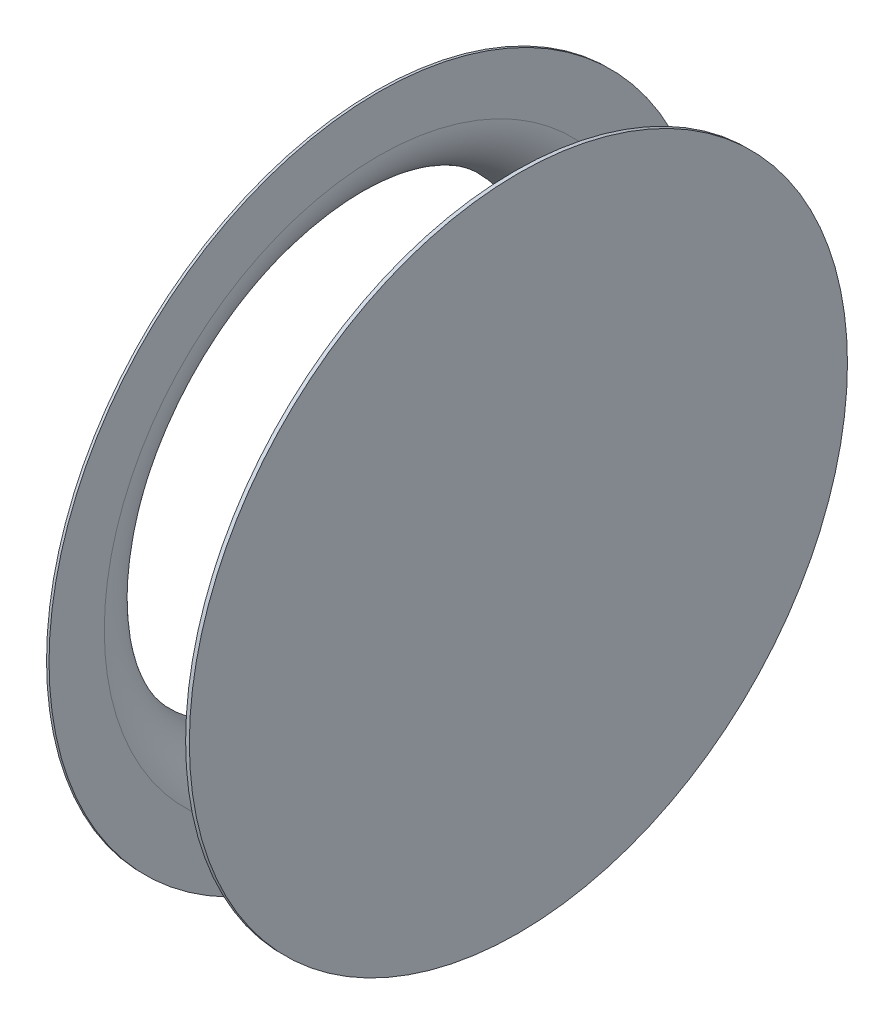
ISO-10303-21;
HEADER;
FILE_DESCRIPTION(('STEP AP214'),'2;1');
FILE_NAME('part.step','',(''),(''),'','','');
FILE_SCHEMA(('AUTOMOTIVE_DESIGN { 1 0 10303 214 1 1 1 1 }'));
ENDSEC;
DATA;
#1=APPLICATION_CONTEXT('core data for automotive mechanical design processes');
#2=APPLICATION_PROTOCOL_DEFINITION('international standard','automotive_design',2000,#1);
#3=PRODUCT_CONTEXT('',#1,'mechanical');
#4=PRODUCT('Part','Part','',(#3));
#5=PRODUCT_RELATED_PRODUCT_CATEGORY('part','',(#4));
#6=PRODUCT_DEFINITION_FORMATION('','',#4);
#7=PRODUCT_DEFINITION_CONTEXT('part definition',#1,'design');
#8=PRODUCT_DEFINITION('design','',#6,#7);
#9=PRODUCT_DEFINITION_SHAPE('','',#8);
#10=(LENGTH_UNIT() NAMED_UNIT(*) SI_UNIT(.MILLI.,.METRE.));
#11=(NAMED_UNIT(*) PLANE_ANGLE_UNIT() SI_UNIT($,.RADIAN.));
#12=(NAMED_UNIT(*) SI_UNIT($,.STERADIAN.) SOLID_ANGLE_UNIT());
#13=UNCERTAINTY_MEASURE_WITH_UNIT(LENGTH_MEASURE(1.E-05),#10,'distance_accuracy_value','');
#14=(GEOMETRIC_REPRESENTATION_CONTEXT(3) GLOBAL_UNCERTAINTY_ASSIGNED_CONTEXT((#13)) GLOBAL_UNIT_ASSIGNED_CONTEXT((#10,
#11,#12)) REPRESENTATION_CONTEXT('',''));
#15=CARTESIAN_POINT('',(0.,0.,0.));
#16=DIRECTION('',(0.,0.,1.));
#17=DIRECTION('',(1.,0.,0.));
#18=AXIS2_PLACEMENT_3D('',#15,#16,#17);
#19=CARTESIAN_POINT('',(-337.763793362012,0.,0.));
#20=DIRECTION('',(-1.,0.,0.));
#21=DIRECTION('',(0.,0.,1.));
#22=AXIS2_PLACEMENT_3D('',#19,#20,#21);
#23=CYLINDRICAL_SURFACE('',#22,530.);
#24=CARTESIAN_POINT('',(-224.,0.,0.));
#25=DIRECTION('',(-1.,0.,0.));
#26=DIRECTION('',(0.,0.,1.));
#27=AXIS2_PLACEMENT_3D('',#24,#25,#26);
#28=CIRCLE('',#27,530.);
#29=CARTESIAN_POINT('',(-224.,0.,530.));
#30=VERTEX_POINT('',#29);
#31=EDGE_CURVE('E57',#30,#30,#28,.T.);
#32=ORIENTED_EDGE('',*,*,#31,.F.);
#33=EDGE_LOOP('',(#32));
#34=FACE_BOUND('',#33,.T.);
#35=CARTESIAN_POINT('',(-220.,0.,0.));
#36=DIRECTION('',(-1.,0.,0.));
#37=DIRECTION('',(0.,0.,1.));
#38=AXIS2_PLACEMENT_3D('',#35,#36,#37);
#39=CIRCLE('',#38,530.);
#40=CARTESIAN_POINT('',(-220.,0.,530.));
#41=VERTEX_POINT('',#40);
#42=EDGE_CURVE('E11',#41,#41,#39,.T.);
#43=ORIENTED_EDGE('',*,*,#42,.T.);
#44=EDGE_LOOP('',(#43));
#45=FACE_BOUND('',#44,.T.);
#46=ADVANCED_FACE('F35',(#34,#45),#23,.T.);
#47=CARTESIAN_POINT('',(-220.,0.,-530.));
#48=DIRECTION('',(-1.,0.,0.));
#49=DIRECTION('',(0.,0.,1.));
#50=AXIS2_PLACEMENT_3D('',#47,#48,#49);
#51=PLANE('',#50);
#52=ORIENTED_EDGE('',*,*,#42,.F.);
#53=EDGE_LOOP('',(#52));
#54=FACE_BOUND('',#53,.T.);
#55=CARTESIAN_POINT('',(-220.,0.,0.));
#56=DIRECTION('',(-1.,0.,0.));
#57=DIRECTION('',(0.,0.,1.));
#58=AXIS2_PLACEMENT_3D('',#55,#56,#57);
#59=CIRCLE('',#58,441.);
#60=CARTESIAN_POINT('',(-220.,0.,441.));
#61=VERTEX_POINT('',#60);
#62=EDGE_CURVE('E41',#61,#61,#59,.T.);
#63=ORIENTED_EDGE('',*,*,#62,.T.);
#64=EDGE_LOOP('',(#63));
#65=FACE_BOUND('',#64,.T.);
#66=ADVANCED_FACE('F64',(#54,#65),#51,.F.);
#67=CARTESIAN_POINT('',(-309.,0.,0.));
#68=DIRECTION('',(-1.,0.,0.));
#69=DIRECTION('',(0.,0.,1.));
#70=AXIS2_PLACEMENT_3D('',#67,#68,#69);
#71=TOROIDAL_SURFACE('',#70,441.,89.);
#72=ORIENTED_EDGE('',*,*,#62,.F.);
#73=EDGE_LOOP('',(#72));
#74=FACE_BOUND('',#73,.T.);
#75=CARTESIAN_POINT('',(-309.,0.,0.));
#76=DIRECTION('',(-1.,0.,0.));
#77=DIRECTION('',(0.,0.,1.));
#78=AXIS2_PLACEMENT_3D('',#75,#76,#77);
#79=CIRCLE('',#78,352.);
#80=CARTESIAN_POINT('',(-309.,0.,352.));
#81=VERTEX_POINT('',#80);
#82=EDGE_CURVE('E45',#81,#81,#79,.T.);
#83=ORIENTED_EDGE('',*,*,#82,.T.);
#84=EDGE_LOOP('',(#83));
#85=FACE_BOUND('',#84,.T.);
#86=ADVANCED_FACE('F68',(#74,#85),#71,.T.);
#87=CARTESIAN_POINT('',(-309.,0.,-356.));
#88=DIRECTION('',(1.,0.,0.));
#89=DIRECTION('',(0.,0.,-1.));
#90=AXIS2_PLACEMENT_3D('',#87,#88,#89);
#91=PLANE('',#90);
#92=ORIENTED_EDGE('',*,*,#82,.F.);
#93=EDGE_LOOP('',(#92));
#94=FACE_BOUND('',#93,.T.);
#95=CARTESIAN_POINT('',(-309.,0.,0.));
#96=DIRECTION('',(-1.,0.,0.));
#97=DIRECTION('',(0.,0.,1.));
#98=AXIS2_PLACEMENT_3D('',#95,#96,#97);
#99=CIRCLE('',#98,356.);
#100=CARTESIAN_POINT('',(-309.,0.,356.));
#101=VERTEX_POINT('',#100);
#102=EDGE_CURVE('E49',#101,#101,#99,.T.);
#103=ORIENTED_EDGE('',*,*,#102,.T.);
#104=EDGE_LOOP('',(#103));
#105=FACE_BOUND('',#104,.T.);
#106=ADVANCED_FACE('F73',(#94,#105),#91,.F.);
#107=CARTESIAN_POINT('',(-309.,0.,0.));
#108=DIRECTION('',(-1.,0.,0.));
#109=DIRECTION('',(0.,0.,1.));
#110=AXIS2_PLACEMENT_3D('',#107,#108,#109);
#111=TOROIDAL_SURFACE('',#110,441.,85.);
#112=ORIENTED_EDGE('',*,*,#102,.F.);
#113=EDGE_LOOP('',(#112));
#114=FACE_BOUND('',#113,.T.);
#115=CARTESIAN_POINT('',(-224.,0.,0.));
#116=DIRECTION('',(-1.,0.,0.));
#117=DIRECTION('',(0.,0.,1.));
#118=AXIS2_PLACEMENT_3D('',#115,#116,#117);
#119=CIRCLE('',#118,441.);
#120=CARTESIAN_POINT('',(-224.,0.,441.));
#121=VERTEX_POINT('',#120);
#122=EDGE_CURVE('E54',#121,#121,#119,.T.);
#123=ORIENTED_EDGE('',*,*,#122,.T.);
#124=EDGE_LOOP('',(#123));
#125=FACE_BOUND('',#124,.T.);
#126=ADVANCED_FACE('F79',(#114,#125),#111,.F.);
#127=CARTESIAN_POINT('',(-224.,0.,-530.));
#128=DIRECTION('',(1.,0.,0.));
#129=DIRECTION('',(0.,0.,-1.));
#130=AXIS2_PLACEMENT_3D('',#127,#128,#129);
#131=PLANE('',#130);
#132=ORIENTED_EDGE('',*,*,#122,.F.);
#133=EDGE_LOOP('',(#132));
#134=FACE_BOUND('',#133,.T.);
#135=ORIENTED_EDGE('',*,*,#31,.T.);
#136=EDGE_LOOP('',(#135));
#137=FACE_BOUND('',#136,.T.);
#138=ADVANCED_FACE('F61',(#134,#137),#131,.F.);
#139=CLOSED_SHELL('',(#46,#66,#86,#106,#126,#138));
#140=MANIFOLD_SOLID_BREP('B2',#139);
#141=CARTESIAN_POINT('',(6.,0.,0.));
#142=DIRECTION('',(-1.,0.,0.));
#143=DIRECTION('',(0.,0.,1.));
#144=AXIS2_PLACEMENT_3D('',#141,#142,#143);
#145=CYLINDRICAL_SURFACE('',#144,530.);
#146=CARTESIAN_POINT('',(6.,0.,0.));
#147=DIRECTION('',(1.,0.,0.));
#148=DIRECTION('',(0.,0.,-1.));
#149=AXIS2_PLACEMENT_3D('',#146,#147,#148);
#150=CIRCLE('',#149,530.);
#151=CARTESIAN_POINT('',(6.,0.,-530.));
#152=VERTEX_POINT('',#151);
#153=EDGE_CURVE('E34',#152,#152,#150,.T.);
#154=ORIENTED_EDGE('',*,*,#153,.F.);
#155=EDGE_LOOP('',(#154));
#156=FACE_BOUND('',#155,.T.);
#157=CARTESIAN_POINT('',(0.,0.,0.));
#158=DIRECTION('',(1.,0.,0.));
#159=DIRECTION('',(0.,0.,-1.));
#160=AXIS2_PLACEMENT_3D('',#157,#158,#159);
#161=CIRCLE('',#160,530.);
#162=CARTESIAN_POINT('',(0.,0.,-530.));
#163=VERTEX_POINT('',#162);
#164=EDGE_CURVE('E121',#163,#163,#161,.T.);
#165=ORIENTED_EDGE('',*,*,#164,.T.);
#166=EDGE_LOOP('',(#165));
#167=FACE_BOUND('',#166,.T.);
#168=ADVANCED_FACE('F115',(#156,#167),#145,.T.);
#169=CARTESIAN_POINT('',(6.,0.,0.));
#170=DIRECTION('',(1.,0.,0.));
#171=DIRECTION('',(0.,0.,-1.));
#172=AXIS2_PLACEMENT_3D('',#169,#170,#171);
#173=PLANE('',#172);
#174=ORIENTED_EDGE('',*,*,#153,.T.);
#175=EDGE_LOOP('',(#174));
#176=FACE_BOUND('',#175,.T.);
#177=ADVANCED_FACE('F130',(#176),#173,.T.);
#178=CARTESIAN_POINT('',(0.,0.,0.));
#179=DIRECTION('',(1.,0.,0.));
#180=DIRECTION('',(0.,0.,-1.));
#181=AXIS2_PLACEMENT_3D('',#178,#179,#180);
#182=PLANE('',#181);
#183=ORIENTED_EDGE('',*,*,#164,.F.);
#184=EDGE_LOOP('',(#183));
#185=FACE_BOUND('',#184,.T.);
#186=ADVANCED_FACE('F128',(#185),#182,.F.);
#187=CLOSED_SHELL('',(#168,#177,#186));
#188=MANIFOLD_SOLID_BREP('B6',#187);
#189=ADVANCED_BREP_SHAPE_REPRESENTATION('',(#18,#140,#188),#14);
#190=SHAPE_DEFINITION_REPRESENTATION(#9,#189);
ENDSEC;
END-ISO-10303-21;
